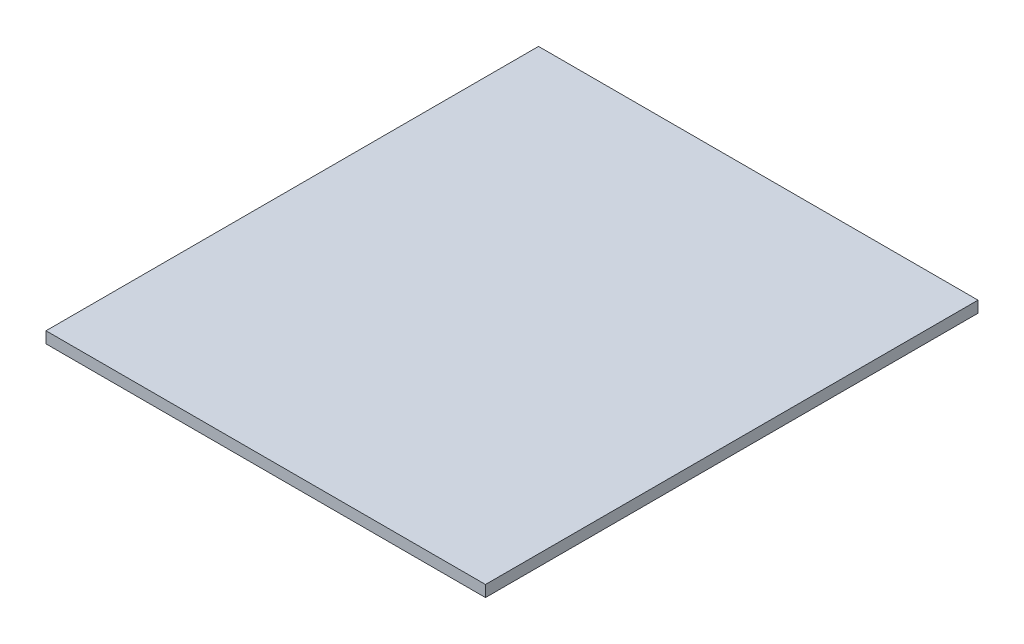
ISO-10303-21;
HEADER;
FILE_DESCRIPTION(('STEP AP214'),'2;1');
FILE_NAME('part.step','',(''),(''),'','','');
FILE_SCHEMA(('AUTOMOTIVE_DESIGN { 1 0 10303 214 1 1 1 1 }'));
ENDSEC;
DATA;
#1=APPLICATION_CONTEXT('core data for automotive mechanical design processes');
#2=APPLICATION_PROTOCOL_DEFINITION('international standard','automotive_design',2000,#1);
#3=PRODUCT_CONTEXT('',#1,'mechanical');
#4=PRODUCT('Part','Part','',(#3));
#5=PRODUCT_RELATED_PRODUCT_CATEGORY('part','',(#4));
#6=PRODUCT_DEFINITION_FORMATION('','',#4);
#7=PRODUCT_DEFINITION_CONTEXT('part definition',#1,'design');
#8=PRODUCT_DEFINITION('design','',#6,#7);
#9=PRODUCT_DEFINITION_SHAPE('','',#8);
#10=(LENGTH_UNIT() NAMED_UNIT(*) SI_UNIT(.MILLI.,.METRE.));
#11=(NAMED_UNIT(*) PLANE_ANGLE_UNIT() SI_UNIT($,.RADIAN.));
#12=(NAMED_UNIT(*) SI_UNIT($,.STERADIAN.) SOLID_ANGLE_UNIT());
#13=UNCERTAINTY_MEASURE_WITH_UNIT(LENGTH_MEASURE(1.E-05),#10,'distance_accuracy_value','');
#14=(GEOMETRIC_REPRESENTATION_CONTEXT(3) GLOBAL_UNCERTAINTY_ASSIGNED_CONTEXT((#13)) GLOBAL_UNIT_ASSIGNED_CONTEXT((#10,
#11,#12)) REPRESENTATION_CONTEXT('',''));
#15=CARTESIAN_POINT('',(0.,0.,0.));
#16=DIRECTION('',(0.,0.,1.));
#17=DIRECTION('',(1.,0.,0.));
#18=AXIS2_PLACEMENT_3D('',#15,#16,#17);
#19=CARTESIAN_POINT('',(-65.6351045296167,-2.64198606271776,130.));
#20=DIRECTION('',(1.,0.,0.));
#21=DIRECTION('',(0.,0.,-1.));
#22=AXIS2_PLACEMENT_3D('',#19,#20,#21);
#23=PLANE('',#22);
#24=DIRECTION('',(0.,-1.,0.));
#25=VECTOR('',#24,1.);
#26=CARTESIAN_POINT('',(-65.6351045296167,-2.64198606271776,0.));
#27=LINE('',#26,#25);
#28=CARTESIAN_POINT('',(-65.6351045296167,-2.64198606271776,0.));
#29=VERTEX_POINT('',#28);
#30=CARTESIAN_POINT('',(-65.6351045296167,-5.64198606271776,0.));
#31=VERTEX_POINT('',#30);
#32=EDGE_CURVE('E79',#29,#31,#27,.T.);
#33=ORIENTED_EDGE('',*,*,#32,.T.);
#34=DIRECTION('',(0.,0.,-1.));
#35=VECTOR('',#34,1.);
#36=CARTESIAN_POINT('',(-65.6351045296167,-5.64198606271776,130.));
#37=LINE('',#36,#35);
#38=CARTESIAN_POINT('',(-65.6351045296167,-5.64198606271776,130.));
#39=VERTEX_POINT('',#38);
#40=EDGE_CURVE('E11',#39,#31,#37,.T.);
#41=ORIENTED_EDGE('',*,*,#40,.F.);
#42=DIRECTION('',(0.,-1.,0.));
#43=VECTOR('',#42,1.);
#44=CARTESIAN_POINT('',(-65.6351045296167,-2.64198606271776,130.));
#45=LINE('',#44,#43);
#46=CARTESIAN_POINT('',(-65.6351045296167,-2.64198606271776,130.));
#47=VERTEX_POINT('',#46);
#48=EDGE_CURVE('E97',#47,#39,#45,.T.);
#49=ORIENTED_EDGE('',*,*,#48,.F.);
#50=DIRECTION('',(0.,0.,-1.));
#51=VECTOR('',#50,1.);
#52=CARTESIAN_POINT('',(-65.6351045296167,-2.64198606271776,130.));
#53=LINE('',#52,#51);
#54=EDGE_CURVE('E91',#47,#29,#53,.T.);
#55=ORIENTED_EDGE('',*,*,#54,.T.);
#56=EDGE_LOOP('',(#33,#41,#49,#55));
#57=FACE_BOUND('',#56,.T.);
#58=ADVANCED_FACE('F35',(#57),#23,.F.);
#59=CARTESIAN_POINT('',(-65.6351045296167,-5.64198606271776,130.));
#60=DIRECTION('',(0.,1.,0.));
#61=DIRECTION('',(0.,0.,1.));
#62=AXIS2_PLACEMENT_3D('',#59,#60,#61);
#63=PLANE('',#62);
#64=DIRECTION('',(1.,0.,0.));
#65=VECTOR('',#64,1.);
#66=CARTESIAN_POINT('',(-65.6351045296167,-5.64198606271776,0.));
#67=LINE('',#66,#65);
#68=CARTESIAN_POINT('',(50.3648954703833,-5.64198606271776,0.));
#69=VERTEX_POINT('',#68);
#70=EDGE_CURVE('E75',#31,#69,#67,.T.);
#71=ORIENTED_EDGE('',*,*,#70,.T.);
#72=DIRECTION('',(0.,0.,-1.));
#73=VECTOR('',#72,1.);
#74=CARTESIAN_POINT('',(50.3648954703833,-5.64198606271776,130.));
#75=LINE('',#74,#73);
#76=CARTESIAN_POINT('',(50.3648954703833,-5.64198606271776,130.));
#77=VERTEX_POINT('',#76);
#78=EDGE_CURVE('E42',#77,#69,#75,.T.);
#79=ORIENTED_EDGE('',*,*,#78,.F.);
#80=DIRECTION('',(1.,0.,0.));
#81=VECTOR('',#80,1.);
#82=CARTESIAN_POINT('',(-65.6351045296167,-5.64198606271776,130.));
#83=LINE('',#82,#81);
#84=EDGE_CURVE('E87',#39,#77,#83,.T.);
#85=ORIENTED_EDGE('',*,*,#84,.F.);
#86=ORIENTED_EDGE('',*,*,#40,.T.);
#87=EDGE_LOOP('',(#71,#79,#85,#86));
#88=FACE_BOUND('',#87,.T.);
#89=ADVANCED_FACE('F86',(#88),#63,.F.);
#90=CARTESIAN_POINT('',(50.3648954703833,-2.64198606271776,130.));
#91=DIRECTION('',(-1.,0.,0.));
#92=DIRECTION('',(0.,0.,1.));
#93=AXIS2_PLACEMENT_3D('',#90,#91,#92);
#94=PLANE('',#93);
#95=DIRECTION('',(0.,1.,0.));
#96=VECTOR('',#95,1.);
#97=CARTESIAN_POINT('',(50.3648954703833,-2.64198606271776,0.));
#98=LINE('',#97,#96);
#99=CARTESIAN_POINT('',(50.3648954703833,-2.64198606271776,0.));
#100=VERTEX_POINT('',#99);
#101=EDGE_CURVE('E80',#69,#100,#98,.T.);
#102=ORIENTED_EDGE('',*,*,#101,.T.);
#103=DIRECTION('',(0.,0.,-1.));
#104=VECTOR('',#103,1.);
#105=CARTESIAN_POINT('',(50.3648954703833,-2.64198606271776,130.));
#106=LINE('',#105,#104);
#107=CARTESIAN_POINT('',(50.3648954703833,-2.64198606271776,130.));
#108=VERTEX_POINT('',#107);
#109=EDGE_CURVE('E103',#108,#100,#106,.T.);
#110=ORIENTED_EDGE('',*,*,#109,.F.);
#111=DIRECTION('',(0.,1.,0.));
#112=VECTOR('',#111,1.);
#113=CARTESIAN_POINT('',(50.3648954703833,-2.64198606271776,130.));
#114=LINE('',#113,#112);
#115=EDGE_CURVE('E54',#77,#108,#114,.T.);
#116=ORIENTED_EDGE('',*,*,#115,.F.);
#117=ORIENTED_EDGE('',*,*,#78,.T.);
#118=EDGE_LOOP('',(#102,#110,#116,#117));
#119=FACE_BOUND('',#118,.T.);
#120=ADVANCED_FACE('F106',(#119),#94,.F.);
#121=CARTESIAN_POINT('',(-65.6351045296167,-2.64198606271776,130.));
#122=DIRECTION('',(0.,-1.,0.));
#123=DIRECTION('',(0.,0.,-1.));
#124=AXIS2_PLACEMENT_3D('',#121,#122,#123);
#125=PLANE('',#124);
#126=DIRECTION('',(-1.,0.,0.));
#127=VECTOR('',#126,1.);
#128=CARTESIAN_POINT('',(-65.6351045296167,-2.64198606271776,0.));
#129=LINE('',#128,#127);
#130=EDGE_CURVE('E95',#100,#29,#129,.T.);
#131=ORIENTED_EDGE('',*,*,#130,.T.);
#132=ORIENTED_EDGE('',*,*,#54,.F.);
#133=DIRECTION('',(-1.,0.,0.));
#134=VECTOR('',#133,1.);
#135=CARTESIAN_POINT('',(-65.6351045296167,-2.64198606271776,130.));
#136=LINE('',#135,#134);
#137=EDGE_CURVE('E49',#108,#47,#136,.T.);
#138=ORIENTED_EDGE('',*,*,#137,.F.);
#139=ORIENTED_EDGE('',*,*,#109,.T.);
#140=EDGE_LOOP('',(#131,#132,#138,#139));
#141=FACE_BOUND('',#140,.T.);
#142=ADVANCED_FACE('F108',(#141),#125,.F.);
#143=CARTESIAN_POINT('',(-65.6351045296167,-5.64198606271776,130.));
#144=DIRECTION('',(0.,0.,1.));
#145=DIRECTION('',(1.,0.,0.));
#146=AXIS2_PLACEMENT_3D('',#143,#144,#145);
#147=PLANE('',#146);
#148=ORIENTED_EDGE('',*,*,#48,.T.);
#149=ORIENTED_EDGE('',*,*,#84,.T.);
#150=ORIENTED_EDGE('',*,*,#115,.T.);
#151=ORIENTED_EDGE('',*,*,#137,.T.);
#152=EDGE_LOOP('',(#148,#149,#150,#151));
#153=FACE_BOUND('',#152,.T.);
#154=ADVANCED_FACE('F109',(#153),#147,.T.);
#155=CARTESIAN_POINT('',(-65.6351045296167,-5.64198606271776,0.));
#156=DIRECTION('',(0.,0.,1.));
#157=DIRECTION('',(1.,0.,0.));
#158=AXIS2_PLACEMENT_3D('',#155,#156,#157);
#159=PLANE('',#158);
#160=ORIENTED_EDGE('',*,*,#32,.F.);
#161=ORIENTED_EDGE('',*,*,#130,.F.);
#162=ORIENTED_EDGE('',*,*,#101,.F.);
#163=ORIENTED_EDGE('',*,*,#70,.F.);
#164=EDGE_LOOP('',(#160,#161,#162,#163));
#165=FACE_BOUND('',#164,.T.);
#166=ADVANCED_FACE('F76',(#165),#159,.F.);
#167=CLOSED_SHELL('',(#58,#89,#120,#142,#154,#166));
#168=MANIFOLD_SOLID_BREP('B2',#167);
#169=ADVANCED_BREP_SHAPE_REPRESENTATION('',(#18,#168),#14);
#170=SHAPE_DEFINITION_REPRESENTATION(#9,#169);
ENDSEC;
END-ISO-10303-21;
